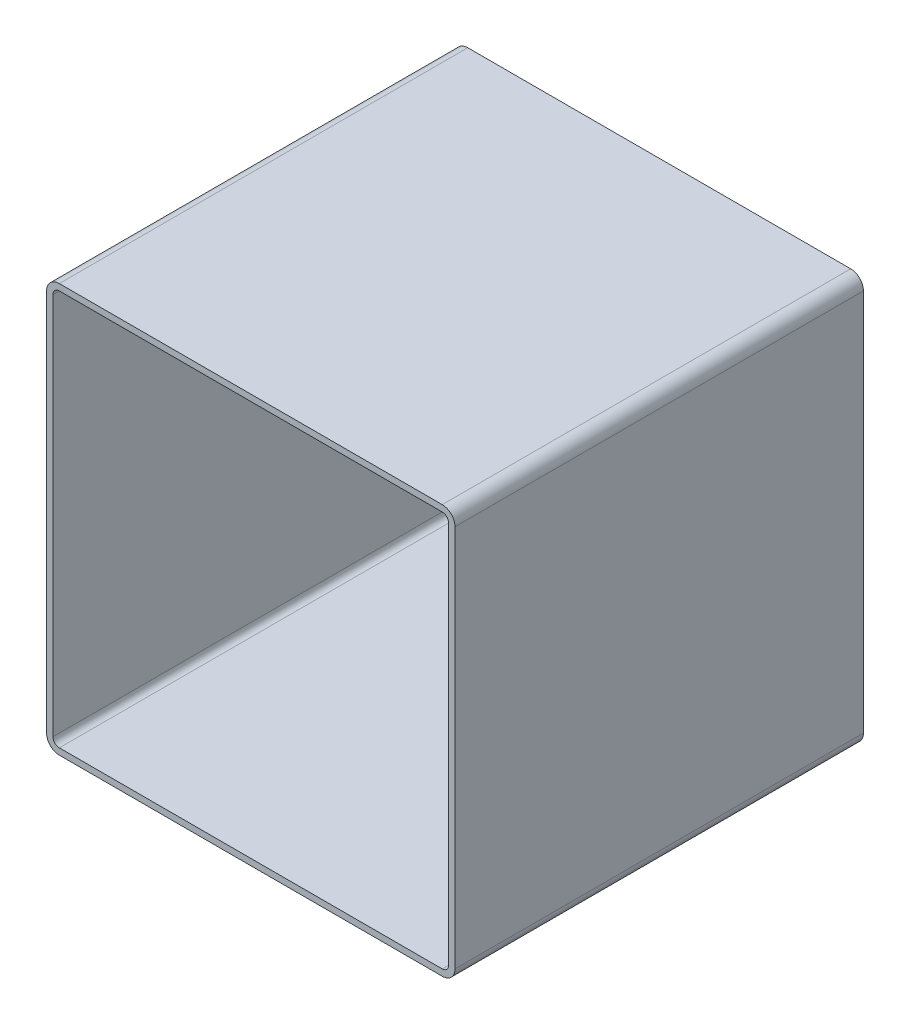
ISO-10303-21;
HEADER;
FILE_DESCRIPTION(('STEP AP214'),'2;1');
FILE_NAME('part.step','',(''),(''),'','','');
FILE_SCHEMA(('AUTOMOTIVE_DESIGN { 1 0 10303 214 1 1 1 1 }'));
ENDSEC;
DATA;
#1=APPLICATION_CONTEXT('core data for automotive mechanical design processes');
#2=APPLICATION_PROTOCOL_DEFINITION('international standard','automotive_design',2000,#1);
#3=PRODUCT_CONTEXT('',#1,'mechanical');
#4=PRODUCT('Part','Part','',(#3));
#5=PRODUCT_RELATED_PRODUCT_CATEGORY('part','',(#4));
#6=PRODUCT_DEFINITION_FORMATION('','',#4);
#7=PRODUCT_DEFINITION_CONTEXT('part definition',#1,'design');
#8=PRODUCT_DEFINITION('design','',#6,#7);
#9=PRODUCT_DEFINITION_SHAPE('','',#8);
#10=(LENGTH_UNIT() NAMED_UNIT(*) SI_UNIT(.MILLI.,.METRE.));
#11=(NAMED_UNIT(*) PLANE_ANGLE_UNIT() SI_UNIT($,.RADIAN.));
#12=(NAMED_UNIT(*) SI_UNIT($,.STERADIAN.) SOLID_ANGLE_UNIT());
#13=UNCERTAINTY_MEASURE_WITH_UNIT(LENGTH_MEASURE(1.E-05),#10,'distance_accuracy_value','');
#14=(GEOMETRIC_REPRESENTATION_CONTEXT(3) GLOBAL_UNCERTAINTY_ASSIGNED_CONTEXT((#13)) GLOBAL_UNIT_ASSIGNED_CONTEXT((#10,
#11,#12)) REPRESENTATION_CONTEXT('',''));
#15=CARTESIAN_POINT('',(0.,0.,0.));
#16=DIRECTION('',(0.,0.,1.));
#17=DIRECTION('',(1.,0.,0.));
#18=AXIS2_PLACEMENT_3D('',#15,#16,#17);
#19=CARTESIAN_POINT('',(10.6317030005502,297.149496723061,304.8));
#20=DIRECTION('',(0.,0.,1.));
#21=DIRECTION('',(1.,0.,0.));
#22=AXIS2_PLACEMENT_3D('',#19,#20,#21);
#23=PLANE('',#22);
#24=CARTESIAN_POINT('',(10.6317030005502,297.149496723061,304.8));
#25=DIRECTION('',(0.,0.,1.));
#26=DIRECTION('',(1.,0.,0.));
#27=AXIS2_PLACEMENT_3D('',#24,#25,#26);
#28=CIRCLE('',#27,9.52500000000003);
#29=CARTESIAN_POINT('',(10.6317030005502,306.674496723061,304.8));
#30=VERTEX_POINT('',#29);
#31=CARTESIAN_POINT('',(1.10670300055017,297.149496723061,304.8));
#32=VERTEX_POINT('',#31);
#33=EDGE_CURVE('E211',#30,#32,#28,.T.);
#34=ORIENTED_EDGE('',*,*,#33,.T.);
#35=DIRECTION('',(0.,-1.,0.));
#36=VECTOR('',#35,1.);
#37=CARTESIAN_POINT('',(1.10670300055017,11.3994967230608,304.8));
#38=LINE('',#37,#36);
#39=CARTESIAN_POINT('',(1.10670300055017,11.3994967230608,304.8));
#40=VERTEX_POINT('',#39);
#41=EDGE_CURVE('E214',#32,#40,#38,.T.);
#42=ORIENTED_EDGE('',*,*,#41,.T.);
#43=CARTESIAN_POINT('',(10.6317030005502,11.3994967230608,304.8));
#44=DIRECTION('',(0.,0.,1.));
#45=DIRECTION('',(1.,0.,0.));
#46=AXIS2_PLACEMENT_3D('',#43,#44,#45);
#47=CIRCLE('',#46,9.525);
#48=CARTESIAN_POINT('',(10.6317030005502,1.87449672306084,304.8));
#49=VERTEX_POINT('',#48);
#50=EDGE_CURVE('E217',#40,#49,#47,.T.);
#51=ORIENTED_EDGE('',*,*,#50,.T.);
#52=DIRECTION('',(1.,0.,0.));
#53=VECTOR('',#52,1.);
#54=CARTESIAN_POINT('',(296.38170300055,1.87449672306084,304.8));
#55=LINE('',#54,#53);
#56=CARTESIAN_POINT('',(296.38170300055,1.87449672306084,304.8));
#57=VERTEX_POINT('',#56);
#58=EDGE_CURVE('E219',#49,#57,#55,.T.);
#59=ORIENTED_EDGE('',*,*,#58,.T.);
#60=CARTESIAN_POINT('',(296.38170300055,11.3994967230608,304.8));
#61=DIRECTION('',(0.,0.,1.));
#62=DIRECTION('',(1.,0.,0.));
#63=AXIS2_PLACEMENT_3D('',#60,#61,#62);
#64=CIRCLE('',#63,9.52500000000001);
#65=CARTESIAN_POINT('',(305.90670300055,11.3994967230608,304.8));
#66=VERTEX_POINT('',#65);
#67=EDGE_CURVE('E221',#57,#66,#64,.T.);
#68=ORIENTED_EDGE('',*,*,#67,.T.);
#69=DIRECTION('',(0.,1.,0.));
#70=VECTOR('',#69,1.);
#71=CARTESIAN_POINT('',(305.90670300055,297.149496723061,304.8));
#72=LINE('',#71,#70);
#73=CARTESIAN_POINT('',(305.90670300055,297.149496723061,304.8));
#74=VERTEX_POINT('',#73);
#75=EDGE_CURVE('E223',#66,#74,#72,.T.);
#76=ORIENTED_EDGE('',*,*,#75,.T.);
#77=CARTESIAN_POINT('',(296.38170300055,297.149496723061,304.8));
#78=DIRECTION('',(0.,0.,1.));
#79=DIRECTION('',(1.,0.,0.));
#80=AXIS2_PLACEMENT_3D('',#77,#78,#79);
#81=CIRCLE('',#80,9.52500000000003);
#82=CARTESIAN_POINT('',(296.38170300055,306.674496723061,304.8));
#83=VERTEX_POINT('',#82);
#84=EDGE_CURVE('E225',#74,#83,#81,.T.);
#85=ORIENTED_EDGE('',*,*,#84,.T.);
#86=DIRECTION('',(-1.,0.,0.));
#87=VECTOR('',#86,1.);
#88=CARTESIAN_POINT('',(10.6317030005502,306.674496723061,304.8));
#89=LINE('',#88,#87);
#90=EDGE_CURVE('E227',#83,#30,#89,.T.);
#91=ORIENTED_EDGE('',*,*,#90,.T.);
#92=EDGE_LOOP('',(#34,#42,#51,#59,#68,#76,#85,#91));
#93=FACE_BOUND('',#92,.T.);
#94=DIRECTION('',(0.,-1.,0.));
#95=VECTOR('',#94,1.);
#96=CARTESIAN_POINT('',(5.86920300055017,11.3994967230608,304.8));
#97=LINE('',#96,#95);
#98=CARTESIAN_POINT('',(5.86920300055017,297.149496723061,304.8));
#99=VERTEX_POINT('',#98);
#100=CARTESIAN_POINT('',(5.86920300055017,11.3994967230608,304.8));
#101=VERTEX_POINT('',#100);
#102=EDGE_CURVE('E154',#99,#101,#97,.T.);
#103=ORIENTED_EDGE('',*,*,#102,.F.);
#104=CARTESIAN_POINT('',(10.6317030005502,297.149496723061,304.8));
#105=DIRECTION('',(0.,0.,1.));
#106=DIRECTION('',(1.,0.,0.));
#107=AXIS2_PLACEMENT_3D('',#104,#105,#106);
#108=CIRCLE('',#107,4.7625);
#109=CARTESIAN_POINT('',(10.6317030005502,301.911996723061,304.8));
#110=VERTEX_POINT('',#109);
#111=EDGE_CURVE('E146',#110,#99,#108,.T.);
#112=ORIENTED_EDGE('',*,*,#111,.F.);
#113=DIRECTION('',(-1.,0.,0.));
#114=VECTOR('',#113,1.);
#115=CARTESIAN_POINT('',(10.6317030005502,301.911996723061,304.8));
#116=LINE('',#115,#114);
#117=CARTESIAN_POINT('',(296.38170300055,301.911996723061,304.8));
#118=VERTEX_POINT('',#117);
#119=EDGE_CURVE('E179',#118,#110,#116,.T.);
#120=ORIENTED_EDGE('',*,*,#119,.F.);
#121=CARTESIAN_POINT('',(296.38170300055,297.149496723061,304.8));
#122=DIRECTION('',(0.,0.,1.));
#123=DIRECTION('',(1.,0.,0.));
#124=AXIS2_PLACEMENT_3D('',#121,#122,#123);
#125=CIRCLE('',#124,4.7625);
#126=CARTESIAN_POINT('',(301.14420300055,297.149496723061,304.8));
#127=VERTEX_POINT('',#126);
#128=EDGE_CURVE('E177',#127,#118,#125,.T.);
#129=ORIENTED_EDGE('',*,*,#128,.F.);
#130=DIRECTION('',(0.,1.,0.));
#131=VECTOR('',#130,1.);
#132=CARTESIAN_POINT('',(301.14420300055,297.149496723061,304.8));
#133=LINE('',#132,#131);
#134=CARTESIAN_POINT('',(301.14420300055,11.3994967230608,304.8));
#135=VERTEX_POINT('',#134);
#136=EDGE_CURVE('E175',#135,#127,#133,.T.);
#137=ORIENTED_EDGE('',*,*,#136,.F.);
#138=CARTESIAN_POINT('',(296.38170300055,11.3994967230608,304.8));
#139=DIRECTION('',(0.,0.,1.));
#140=DIRECTION('',(1.,0.,0.));
#141=AXIS2_PLACEMENT_3D('',#138,#139,#140);
#142=CIRCLE('',#141,4.7625);
#143=CARTESIAN_POINT('',(296.38170300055,6.63699672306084,304.8));
#144=VERTEX_POINT('',#143);
#145=EDGE_CURVE('E173',#144,#135,#142,.T.);
#146=ORIENTED_EDGE('',*,*,#145,.F.);
#147=DIRECTION('',(1.,0.,0.));
#148=VECTOR('',#147,1.);
#149=CARTESIAN_POINT('',(296.38170300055,6.63699672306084,304.8));
#150=LINE('',#149,#148);
#151=CARTESIAN_POINT('',(10.6317030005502,6.63699672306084,304.8));
#152=VERTEX_POINT('',#151);
#153=EDGE_CURVE('E169',#152,#144,#150,.T.);
#154=ORIENTED_EDGE('',*,*,#153,.F.);
#155=CARTESIAN_POINT('',(10.6317030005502,11.3994967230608,304.8));
#156=DIRECTION('',(0.,0.,1.));
#157=DIRECTION('',(1.,0.,0.));
#158=AXIS2_PLACEMENT_3D('',#155,#156,#157);
#159=CIRCLE('',#158,4.7625);
#160=EDGE_CURVE('E167',#101,#152,#159,.T.);
#161=ORIENTED_EDGE('',*,*,#160,.F.);
#162=EDGE_LOOP('',(#103,#112,#120,#129,#137,#146,#154,#161));
#163=FACE_BOUND('',#162,.T.);
#164=ADVANCED_FACE('F33',(#93,#163),#23,.T.);
#165=CARTESIAN_POINT('',(10.6317030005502,297.149496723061,0.));
#166=DIRECTION('',(0.,0.,1.));
#167=DIRECTION('',(1.,0.,0.));
#168=AXIS2_PLACEMENT_3D('',#165,#166,#167);
#169=PLANE('',#168);
#170=CARTESIAN_POINT('',(10.6317030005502,297.149496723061,0.));
#171=DIRECTION('',(0.,0.,1.));
#172=DIRECTION('',(1.,0.,0.));
#173=AXIS2_PLACEMENT_3D('',#170,#171,#172);
#174=CIRCLE('',#173,9.52500000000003);
#175=CARTESIAN_POINT('',(10.6317030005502,306.674496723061,0.));
#176=VERTEX_POINT('',#175);
#177=CARTESIAN_POINT('',(1.10670300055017,297.149496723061,0.));
#178=VERTEX_POINT('',#177);
#179=EDGE_CURVE('E162',#176,#178,#174,.T.);
#180=ORIENTED_EDGE('',*,*,#179,.F.);
#181=DIRECTION('',(-1.,0.,0.));
#182=VECTOR('',#181,1.);
#183=CARTESIAN_POINT('',(10.6317030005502,306.674496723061,0.));
#184=LINE('',#183,#182);
#185=CARTESIAN_POINT('',(296.38170300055,306.674496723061,0.));
#186=VERTEX_POINT('',#185);
#187=EDGE_CURVE('E215',#186,#176,#184,.T.);
#188=ORIENTED_EDGE('',*,*,#187,.F.);
#189=CARTESIAN_POINT('',(296.38170300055,297.149496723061,0.));
#190=DIRECTION('',(0.,0.,1.));
#191=DIRECTION('',(1.,0.,0.));
#192=AXIS2_PLACEMENT_3D('',#189,#190,#191);
#193=CIRCLE('',#192,9.52500000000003);
#194=CARTESIAN_POINT('',(305.90670300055,297.149496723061,0.));
#195=VERTEX_POINT('',#194);
#196=EDGE_CURVE('E242',#195,#186,#193,.T.);
#197=ORIENTED_EDGE('',*,*,#196,.F.);
#198=DIRECTION('',(0.,1.,0.));
#199=VECTOR('',#198,1.);
#200=CARTESIAN_POINT('',(305.90670300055,297.149496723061,0.));
#201=LINE('',#200,#199);
#202=CARTESIAN_POINT('',(305.90670300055,11.3994967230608,0.));
#203=VERTEX_POINT('',#202);
#204=EDGE_CURVE('E240',#203,#195,#201,.T.);
#205=ORIENTED_EDGE('',*,*,#204,.F.);
#206=CARTESIAN_POINT('',(296.38170300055,11.3994967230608,0.));
#207=DIRECTION('',(0.,0.,1.));
#208=DIRECTION('',(1.,0.,0.));
#209=AXIS2_PLACEMENT_3D('',#206,#207,#208);
#210=CIRCLE('',#209,9.52500000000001);
#211=CARTESIAN_POINT('',(296.38170300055,1.87449672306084,0.));
#212=VERTEX_POINT('',#211);
#213=EDGE_CURVE('E238',#212,#203,#210,.T.);
#214=ORIENTED_EDGE('',*,*,#213,.F.);
#215=DIRECTION('',(1.,0.,0.));
#216=VECTOR('',#215,1.);
#217=CARTESIAN_POINT('',(296.38170300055,1.87449672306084,0.));
#218=LINE('',#217,#216);
#219=CARTESIAN_POINT('',(10.6317030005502,1.87449672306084,0.));
#220=VERTEX_POINT('',#219);
#221=EDGE_CURVE('E236',#220,#212,#218,.T.);
#222=ORIENTED_EDGE('',*,*,#221,.F.);
#223=CARTESIAN_POINT('',(10.6317030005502,11.3994967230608,0.));
#224=DIRECTION('',(0.,0.,1.));
#225=DIRECTION('',(1.,0.,0.));
#226=AXIS2_PLACEMENT_3D('',#223,#224,#225);
#227=CIRCLE('',#226,9.525);
#228=CARTESIAN_POINT('',(1.10670300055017,11.3994967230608,0.));
#229=VERTEX_POINT('',#228);
#230=EDGE_CURVE('E234',#229,#220,#227,.T.);
#231=ORIENTED_EDGE('',*,*,#230,.F.);
#232=DIRECTION('',(0.,-1.,0.));
#233=VECTOR('',#232,1.);
#234=CARTESIAN_POINT('',(1.10670300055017,11.3994967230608,0.));
#235=LINE('',#234,#233);
#236=EDGE_CURVE('E232',#178,#229,#235,.T.);
#237=ORIENTED_EDGE('',*,*,#236,.F.);
#238=EDGE_LOOP('',(#180,#188,#197,#205,#214,#222,#231,#237));
#239=FACE_BOUND('',#238,.T.);
#240=CARTESIAN_POINT('',(10.6317030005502,297.149496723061,0.));
#241=DIRECTION('',(0.,0.,1.));
#242=DIRECTION('',(1.,0.,0.));
#243=AXIS2_PLACEMENT_3D('',#240,#241,#242);
#244=CIRCLE('',#243,4.7625);
#245=CARTESIAN_POINT('',(10.6317030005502,301.911996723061,0.));
#246=VERTEX_POINT('',#245);
#247=CARTESIAN_POINT('',(5.86920300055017,297.149496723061,0.));
#248=VERTEX_POINT('',#247);
#249=EDGE_CURVE('E56',#246,#248,#244,.T.);
#250=ORIENTED_EDGE('',*,*,#249,.T.);
#251=DIRECTION('',(0.,-1.,0.));
#252=VECTOR('',#251,1.);
#253=CARTESIAN_POINT('',(5.86920300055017,11.3994967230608,0.));
#254=LINE('',#253,#252);
#255=CARTESIAN_POINT('',(5.86920300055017,11.3994967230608,0.));
#256=VERTEX_POINT('',#255);
#257=EDGE_CURVE('E161',#248,#256,#254,.T.);
#258=ORIENTED_EDGE('',*,*,#257,.T.);
#259=CARTESIAN_POINT('',(10.6317030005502,11.3994967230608,0.));
#260=DIRECTION('',(0.,0.,1.));
#261=DIRECTION('',(1.,0.,0.));
#262=AXIS2_PLACEMENT_3D('',#259,#260,#261);
#263=CIRCLE('',#262,4.7625);
#264=CARTESIAN_POINT('',(10.6317030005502,6.63699672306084,0.));
#265=VERTEX_POINT('',#264);
#266=EDGE_CURVE('E183',#256,#265,#263,.T.);
#267=ORIENTED_EDGE('',*,*,#266,.T.);
#268=DIRECTION('',(1.,0.,0.));
#269=VECTOR('',#268,1.);
#270=CARTESIAN_POINT('',(296.38170300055,6.63699672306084,0.));
#271=LINE('',#270,#269);
#272=CARTESIAN_POINT('',(296.38170300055,6.63699672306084,0.));
#273=VERTEX_POINT('',#272);
#274=EDGE_CURVE('E186',#265,#273,#271,.T.);
#275=ORIENTED_EDGE('',*,*,#274,.T.);
#276=CARTESIAN_POINT('',(296.38170300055,11.3994967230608,0.));
#277=DIRECTION('',(0.,0.,1.));
#278=DIRECTION('',(1.,0.,0.));
#279=AXIS2_PLACEMENT_3D('',#276,#277,#278);
#280=CIRCLE('',#279,4.7625);
#281=CARTESIAN_POINT('',(301.14420300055,11.3994967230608,0.));
#282=VERTEX_POINT('',#281);
#283=EDGE_CURVE('E189',#273,#282,#280,.T.);
#284=ORIENTED_EDGE('',*,*,#283,.T.);
#285=DIRECTION('',(0.,1.,0.));
#286=VECTOR('',#285,1.);
#287=CARTESIAN_POINT('',(301.14420300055,297.149496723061,0.));
#288=LINE('',#287,#286);
#289=CARTESIAN_POINT('',(301.14420300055,297.149496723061,0.));
#290=VERTEX_POINT('',#289);
#291=EDGE_CURVE('E192',#282,#290,#288,.T.);
#292=ORIENTED_EDGE('',*,*,#291,.T.);
#293=CARTESIAN_POINT('',(296.38170300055,297.149496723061,0.));
#294=DIRECTION('',(0.,0.,1.));
#295=DIRECTION('',(1.,0.,0.));
#296=AXIS2_PLACEMENT_3D('',#293,#294,#295);
#297=CIRCLE('',#296,4.7625);
#298=CARTESIAN_POINT('',(296.38170300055,301.911996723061,0.));
#299=VERTEX_POINT('',#298);
#300=EDGE_CURVE('E195',#290,#299,#297,.T.);
#301=ORIENTED_EDGE('',*,*,#300,.T.);
#302=DIRECTION('',(-1.,0.,0.));
#303=VECTOR('',#302,1.);
#304=CARTESIAN_POINT('',(10.6317030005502,301.911996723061,0.));
#305=LINE('',#304,#303);
#306=EDGE_CURVE('E155',#299,#246,#305,.T.);
#307=ORIENTED_EDGE('',*,*,#306,.T.);
#308=EDGE_LOOP('',(#250,#258,#267,#275,#284,#292,#301,#307));
#309=FACE_BOUND('',#308,.T.);
#310=ADVANCED_FACE('F272',(#239,#309),#169,.F.);
#311=CARTESIAN_POINT('',(10.6317030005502,297.149496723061,304.8));
#312=DIRECTION('',(0.,0.,-1.));
#313=DIRECTION('',(-1.,0.,0.));
#314=AXIS2_PLACEMENT_3D('',#311,#312,#313);
#315=CYLINDRICAL_SURFACE('',#314,9.52500000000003);
#316=ORIENTED_EDGE('',*,*,#179,.T.);
#317=DIRECTION('',(0.,0.,-1.));
#318=VECTOR('',#317,1.);
#319=CARTESIAN_POINT('',(1.10670300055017,297.149496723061,304.8));
#320=LINE('',#319,#318);
#321=EDGE_CURVE('E11',#32,#178,#320,.T.);
#322=ORIENTED_EDGE('',*,*,#321,.F.);
#323=ORIENTED_EDGE('',*,*,#33,.F.);
#324=DIRECTION('',(0.,0.,-1.));
#325=VECTOR('',#324,1.);
#326=CARTESIAN_POINT('',(10.6317030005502,306.674496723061,304.8));
#327=LINE('',#326,#325);
#328=EDGE_CURVE('E229',#30,#176,#327,.T.);
#329=ORIENTED_EDGE('',*,*,#328,.T.);
#330=EDGE_LOOP('',(#316,#322,#323,#329));
#331=FACE_BOUND('',#330,.T.);
#332=ADVANCED_FACE('F35',(#331),#315,.T.);
#333=CARTESIAN_POINT('',(1.10670300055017,11.3994967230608,304.8));
#334=DIRECTION('',(1.,0.,0.));
#335=DIRECTION('',(0.,0.,-1.));
#336=AXIS2_PLACEMENT_3D('',#333,#334,#335);
#337=PLANE('',#336);
#338=ORIENTED_EDGE('',*,*,#236,.T.);
#339=DIRECTION('',(0.,0.,-1.));
#340=VECTOR('',#339,1.);
#341=CARTESIAN_POINT('',(1.10670300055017,11.3994967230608,304.8));
#342=LINE('',#341,#340);
#343=EDGE_CURVE('E41',#40,#229,#342,.T.);
#344=ORIENTED_EDGE('',*,*,#343,.F.);
#345=ORIENTED_EDGE('',*,*,#41,.F.);
#346=ORIENTED_EDGE('',*,*,#321,.T.);
#347=EDGE_LOOP('',(#338,#344,#345,#346));
#348=FACE_BOUND('',#347,.T.);
#349=ADVANCED_FACE('F289',(#348),#337,.F.);
#350=CARTESIAN_POINT('',(10.6317030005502,11.3994967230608,304.8));
#351=DIRECTION('',(0.,0.,-1.));
#352=DIRECTION('',(-1.,0.,0.));
#353=AXIS2_PLACEMENT_3D('',#350,#351,#352);
#354=CYLINDRICAL_SURFACE('',#353,9.525);
#355=ORIENTED_EDGE('',*,*,#230,.T.);
#356=DIRECTION('',(0.,0.,-1.));
#357=VECTOR('',#356,1.);
#358=CARTESIAN_POINT('',(10.6317030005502,1.87449672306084,304.8));
#359=LINE('',#358,#357);
#360=EDGE_CURVE('E259',#49,#220,#359,.T.);
#361=ORIENTED_EDGE('',*,*,#360,.F.);
#362=ORIENTED_EDGE('',*,*,#50,.F.);
#363=ORIENTED_EDGE('',*,*,#343,.T.);
#364=EDGE_LOOP('',(#355,#361,#362,#363));
#365=FACE_BOUND('',#364,.T.);
#366=ADVANCED_FACE('F266',(#365),#354,.T.);
#367=CARTESIAN_POINT('',(296.38170300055,1.87449672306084,304.8));
#368=DIRECTION('',(0.,1.,0.));
#369=DIRECTION('',(0.,0.,1.));
#370=AXIS2_PLACEMENT_3D('',#367,#368,#369);
#371=PLANE('',#370);
#372=ORIENTED_EDGE('',*,*,#221,.T.);
#373=DIRECTION('',(0.,0.,-1.));
#374=VECTOR('',#373,1.);
#375=CARTESIAN_POINT('',(296.38170300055,1.87449672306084,304.8));
#376=LINE('',#375,#374);
#377=EDGE_CURVE('E256',#57,#212,#376,.T.);
#378=ORIENTED_EDGE('',*,*,#377,.F.);
#379=ORIENTED_EDGE('',*,*,#58,.F.);
#380=ORIENTED_EDGE('',*,*,#360,.T.);
#381=EDGE_LOOP('',(#372,#378,#379,#380));
#382=FACE_BOUND('',#381,.T.);
#383=ADVANCED_FACE('F278',(#382),#371,.F.);
#384=CARTESIAN_POINT('',(296.38170300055,11.3994967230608,304.8));
#385=DIRECTION('',(0.,0.,-1.));
#386=DIRECTION('',(-1.,0.,0.));
#387=AXIS2_PLACEMENT_3D('',#384,#385,#386);
#388=CYLINDRICAL_SURFACE('',#387,9.52500000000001);
#389=ORIENTED_EDGE('',*,*,#213,.T.);
#390=DIRECTION('',(0.,0.,-1.));
#391=VECTOR('',#390,1.);
#392=CARTESIAN_POINT('',(305.90670300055,11.3994967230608,304.8));
#393=LINE('',#392,#391);
#394=EDGE_CURVE('E253',#66,#203,#393,.T.);
#395=ORIENTED_EDGE('',*,*,#394,.F.);
#396=ORIENTED_EDGE('',*,*,#67,.F.);
#397=ORIENTED_EDGE('',*,*,#377,.T.);
#398=EDGE_LOOP('',(#389,#395,#396,#397));
#399=FACE_BOUND('',#398,.T.);
#400=ADVANCED_FACE('F282',(#399),#388,.T.);
#401=CARTESIAN_POINT('',(305.90670300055,297.149496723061,304.8));
#402=DIRECTION('',(-1.,0.,0.));
#403=DIRECTION('',(0.,0.,1.));
#404=AXIS2_PLACEMENT_3D('',#401,#402,#403);
#405=PLANE('',#404);
#406=ORIENTED_EDGE('',*,*,#204,.T.);
#407=DIRECTION('',(0.,0.,-1.));
#408=VECTOR('',#407,1.);
#409=CARTESIAN_POINT('',(305.90670300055,297.149496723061,304.8));
#410=LINE('',#409,#408);
#411=EDGE_CURVE('E250',#74,#195,#410,.T.);
#412=ORIENTED_EDGE('',*,*,#411,.F.);
#413=ORIENTED_EDGE('',*,*,#75,.F.);
#414=ORIENTED_EDGE('',*,*,#394,.T.);
#415=EDGE_LOOP('',(#406,#412,#413,#414));
#416=FACE_BOUND('',#415,.T.);
#417=ADVANCED_FACE('F302',(#416),#405,.F.);
#418=CARTESIAN_POINT('',(296.38170300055,297.149496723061,304.8));
#419=DIRECTION('',(0.,0.,-1.));
#420=DIRECTION('',(-1.,0.,0.));
#421=AXIS2_PLACEMENT_3D('',#418,#419,#420);
#422=CYLINDRICAL_SURFACE('',#421,9.52500000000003);
#423=ORIENTED_EDGE('',*,*,#196,.T.);
#424=DIRECTION('',(0.,0.,-1.));
#425=VECTOR('',#424,1.);
#426=CARTESIAN_POINT('',(296.38170300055,306.674496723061,304.8));
#427=LINE('',#426,#425);
#428=EDGE_CURVE('E247',#83,#186,#427,.T.);
#429=ORIENTED_EDGE('',*,*,#428,.F.);
#430=ORIENTED_EDGE('',*,*,#84,.F.);
#431=ORIENTED_EDGE('',*,*,#411,.T.);
#432=EDGE_LOOP('',(#423,#429,#430,#431));
#433=FACE_BOUND('',#432,.T.);
#434=ADVANCED_FACE('F300',(#433),#422,.T.);
#435=CARTESIAN_POINT('',(10.6317030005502,306.674496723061,304.8));
#436=DIRECTION('',(0.,-1.,0.));
#437=DIRECTION('',(0.,0.,-1.));
#438=AXIS2_PLACEMENT_3D('',#435,#436,#437);
#439=PLANE('',#438);
#440=ORIENTED_EDGE('',*,*,#187,.T.);
#441=ORIENTED_EDGE('',*,*,#328,.F.);
#442=ORIENTED_EDGE('',*,*,#90,.F.);
#443=ORIENTED_EDGE('',*,*,#428,.T.);
#444=EDGE_LOOP('',(#440,#441,#442,#443));
#445=FACE_BOUND('',#444,.T.);
#446=ADVANCED_FACE('F295',(#445),#439,.F.);
#447=CARTESIAN_POINT('',(10.6317030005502,297.149496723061,304.8));
#448=DIRECTION('',(0.,0.,-1.));
#449=DIRECTION('',(-1.,0.,0.));
#450=AXIS2_PLACEMENT_3D('',#447,#448,#449);
#451=CYLINDRICAL_SURFACE('',#450,4.7625);
#452=ORIENTED_EDGE('',*,*,#249,.F.);
#453=DIRECTION('',(0.,0.,-1.));
#454=VECTOR('',#453,1.);
#455=CARTESIAN_POINT('',(10.6317030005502,301.911996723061,304.8));
#456=LINE('',#455,#454);
#457=EDGE_CURVE('E150',#110,#246,#456,.T.);
#458=ORIENTED_EDGE('',*,*,#457,.F.);
#459=ORIENTED_EDGE('',*,*,#111,.T.);
#460=DIRECTION('',(0.,0.,-1.));
#461=VECTOR('',#460,1.);
#462=CARTESIAN_POINT('',(5.86920300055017,297.149496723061,304.8));
#463=LINE('',#462,#461);
#464=EDGE_CURVE('E149',#99,#248,#463,.T.);
#465=ORIENTED_EDGE('',*,*,#464,.T.);
#466=EDGE_LOOP('',(#452,#458,#459,#465));
#467=FACE_BOUND('',#466,.T.);
#468=ADVANCED_FACE('F148',(#467),#451,.F.);
#469=CARTESIAN_POINT('',(5.86920300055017,11.3994967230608,304.8));
#470=DIRECTION('',(1.,0.,0.));
#471=DIRECTION('',(0.,0.,-1.));
#472=AXIS2_PLACEMENT_3D('',#469,#470,#471);
#473=PLANE('',#472);
#474=ORIENTED_EDGE('',*,*,#257,.F.);
#475=ORIENTED_EDGE('',*,*,#464,.F.);
#476=ORIENTED_EDGE('',*,*,#102,.T.);
#477=DIRECTION('',(0.,0.,-1.));
#478=VECTOR('',#477,1.);
#479=CARTESIAN_POINT('',(5.86920300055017,11.3994967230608,304.8));
#480=LINE('',#479,#478);
#481=EDGE_CURVE('E163',#101,#256,#480,.T.);
#482=ORIENTED_EDGE('',*,*,#481,.T.);
#483=EDGE_LOOP('',(#474,#475,#476,#482));
#484=FACE_BOUND('',#483,.T.);
#485=ADVANCED_FACE('F158',(#484),#473,.T.);
#486=CARTESIAN_POINT('',(10.6317030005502,11.3994967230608,304.8));
#487=DIRECTION('',(0.,0.,-1.));
#488=DIRECTION('',(-1.,0.,0.));
#489=AXIS2_PLACEMENT_3D('',#486,#487,#488);
#490=CYLINDRICAL_SURFACE('',#489,4.7625);
#491=ORIENTED_EDGE('',*,*,#266,.F.);
#492=ORIENTED_EDGE('',*,*,#481,.F.);
#493=ORIENTED_EDGE('',*,*,#160,.T.);
#494=DIRECTION('',(0.,0.,-1.));
#495=VECTOR('',#494,1.);
#496=CARTESIAN_POINT('',(10.6317030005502,6.63699672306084,304.8));
#497=LINE('',#496,#495);
#498=EDGE_CURVE('E208',#152,#265,#497,.T.);
#499=ORIENTED_EDGE('',*,*,#498,.T.);
#500=EDGE_LOOP('',(#491,#492,#493,#499));
#501=FACE_BOUND('',#500,.T.);
#502=ADVANCED_FACE('F327',(#501),#490,.F.);
#503=CARTESIAN_POINT('',(296.38170300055,6.63699672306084,304.8));
#504=DIRECTION('',(0.,1.,0.));
#505=DIRECTION('',(0.,0.,1.));
#506=AXIS2_PLACEMENT_3D('',#503,#504,#505);
#507=PLANE('',#506);
#508=ORIENTED_EDGE('',*,*,#274,.F.);
#509=ORIENTED_EDGE('',*,*,#498,.F.);
#510=ORIENTED_EDGE('',*,*,#153,.T.);
#511=DIRECTION('',(0.,0.,-1.));
#512=VECTOR('',#511,1.);
#513=CARTESIAN_POINT('',(296.38170300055,6.63699672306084,304.8));
#514=LINE('',#513,#512);
#515=EDGE_CURVE('E206',#144,#273,#514,.T.);
#516=ORIENTED_EDGE('',*,*,#515,.T.);
#517=EDGE_LOOP('',(#508,#509,#510,#516));
#518=FACE_BOUND('',#517,.T.);
#519=ADVANCED_FACE('F331',(#518),#507,.T.);
#520=CARTESIAN_POINT('',(296.38170300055,11.3994967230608,304.8));
#521=DIRECTION('',(0.,0.,-1.));
#522=DIRECTION('',(-1.,0.,0.));
#523=AXIS2_PLACEMENT_3D('',#520,#521,#522);
#524=CYLINDRICAL_SURFACE('',#523,4.7625);
#525=ORIENTED_EDGE('',*,*,#283,.F.);
#526=ORIENTED_EDGE('',*,*,#515,.F.);
#527=ORIENTED_EDGE('',*,*,#145,.T.);
#528=DIRECTION('',(0.,0.,-1.));
#529=VECTOR('',#528,1.);
#530=CARTESIAN_POINT('',(301.14420300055,11.3994967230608,304.8));
#531=LINE('',#530,#529);
#532=EDGE_CURVE('E204',#135,#282,#531,.T.);
#533=ORIENTED_EDGE('',*,*,#532,.T.);
#534=EDGE_LOOP('',(#525,#526,#527,#533));
#535=FACE_BOUND('',#534,.T.);
#536=ADVANCED_FACE('F337',(#535),#524,.F.);
#537=CARTESIAN_POINT('',(301.14420300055,297.149496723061,304.8));
#538=DIRECTION('',(-1.,0.,0.));
#539=DIRECTION('',(0.,0.,1.));
#540=AXIS2_PLACEMENT_3D('',#537,#538,#539);
#541=PLANE('',#540);
#542=ORIENTED_EDGE('',*,*,#291,.F.);
#543=ORIENTED_EDGE('',*,*,#532,.F.);
#544=ORIENTED_EDGE('',*,*,#136,.T.);
#545=DIRECTION('',(0.,0.,-1.));
#546=VECTOR('',#545,1.);
#547=CARTESIAN_POINT('',(301.14420300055,297.149496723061,304.8));
#548=LINE('',#547,#546);
#549=EDGE_CURVE('E202',#127,#290,#548,.T.);
#550=ORIENTED_EDGE('',*,*,#549,.T.);
#551=EDGE_LOOP('',(#542,#543,#544,#550));
#552=FACE_BOUND('',#551,.T.);
#553=ADVANCED_FACE('F341',(#552),#541,.T.);
#554=CARTESIAN_POINT('',(296.38170300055,297.149496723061,304.8));
#555=DIRECTION('',(0.,0.,-1.));
#556=DIRECTION('',(-1.,0.,0.));
#557=AXIS2_PLACEMENT_3D('',#554,#555,#556);
#558=CYLINDRICAL_SURFACE('',#557,4.7625);
#559=ORIENTED_EDGE('',*,*,#300,.F.);
#560=ORIENTED_EDGE('',*,*,#549,.F.);
#561=ORIENTED_EDGE('',*,*,#128,.T.);
#562=DIRECTION('',(0.,0.,-1.));
#563=VECTOR('',#562,1.);
#564=CARTESIAN_POINT('',(296.38170300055,301.911996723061,304.8));
#565=LINE('',#564,#563);
#566=EDGE_CURVE('E48',#118,#299,#565,.T.);
#567=ORIENTED_EDGE('',*,*,#566,.T.);
#568=EDGE_LOOP('',(#559,#560,#561,#567));
#569=FACE_BOUND('',#568,.T.);
#570=ADVANCED_FACE('F345',(#569),#558,.F.);
#571=CARTESIAN_POINT('',(10.6317030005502,301.911996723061,304.8));
#572=DIRECTION('',(0.,-1.,0.));
#573=DIRECTION('',(0.,0.,-1.));
#574=AXIS2_PLACEMENT_3D('',#571,#572,#573);
#575=PLANE('',#574);
#576=ORIENTED_EDGE('',*,*,#306,.F.);
#577=ORIENTED_EDGE('',*,*,#566,.F.);
#578=ORIENTED_EDGE('',*,*,#119,.T.);
#579=ORIENTED_EDGE('',*,*,#457,.T.);
#580=EDGE_LOOP('',(#576,#577,#578,#579));
#581=FACE_BOUND('',#580,.T.);
#582=ADVANCED_FACE('F349',(#581),#575,.T.);
#583=CLOSED_SHELL('',(#164,#310,#332,#349,#366,#383,#400,#417,#434,#446,#468,#485,#502,#519,
#536,#553,#570,#582));
#584=MANIFOLD_SOLID_BREP('B2',#583);
#585=ADVANCED_BREP_SHAPE_REPRESENTATION('',(#18,#584),#14);
#586=SHAPE_DEFINITION_REPRESENTATION(#9,#585);
ENDSEC;
END-ISO-10303-21;
